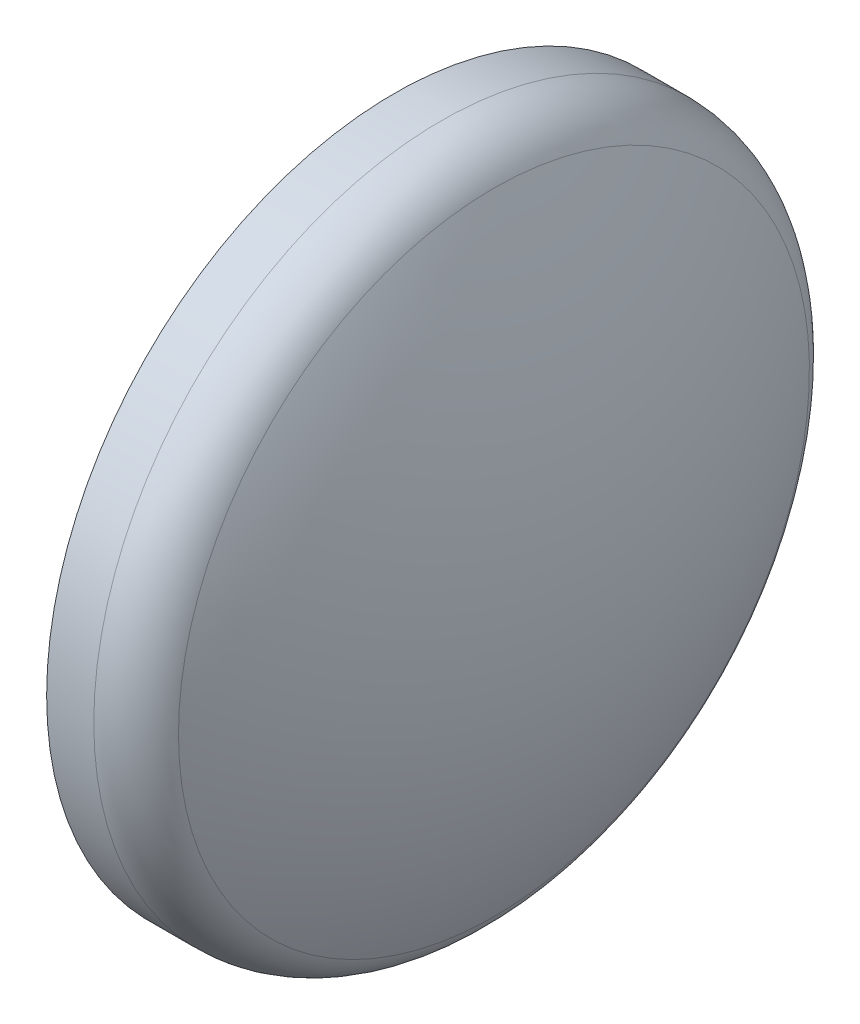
ISO-10303-21;
HEADER;
FILE_DESCRIPTION(('STEP AP214'),'2;1');
FILE_NAME('part.step','',(''),(''),'','','');
FILE_SCHEMA(('AUTOMOTIVE_DESIGN { 1 0 10303 214 1 1 1 1 }'));
ENDSEC;
DATA;
#1=APPLICATION_CONTEXT('core data for automotive mechanical design processes');
#2=APPLICATION_PROTOCOL_DEFINITION('international standard','automotive_design',2000,#1);
#3=PRODUCT_CONTEXT('',#1,'mechanical');
#4=PRODUCT('Part','Part','',(#3));
#5=PRODUCT_RELATED_PRODUCT_CATEGORY('part','',(#4));
#6=PRODUCT_DEFINITION_FORMATION('','',#4);
#7=PRODUCT_DEFINITION_CONTEXT('part definition',#1,'design');
#8=PRODUCT_DEFINITION('design','',#6,#7);
#9=PRODUCT_DEFINITION_SHAPE('','',#8);
#10=(LENGTH_UNIT() NAMED_UNIT(*) SI_UNIT(.MILLI.,.METRE.));
#11=(NAMED_UNIT(*) PLANE_ANGLE_UNIT() SI_UNIT($,.RADIAN.));
#12=(NAMED_UNIT(*) SI_UNIT($,.STERADIAN.) SOLID_ANGLE_UNIT());
#13=UNCERTAINTY_MEASURE_WITH_UNIT(LENGTH_MEASURE(1.E-05),#10,'distance_accuracy_value','');
#14=(GEOMETRIC_REPRESENTATION_CONTEXT(3) GLOBAL_UNCERTAINTY_ASSIGNED_CONTEXT((#13)) GLOBAL_UNIT_ASSIGNED_CONTEXT((#10,
#11,#12)) REPRESENTATION_CONTEXT('',''));
#15=CARTESIAN_POINT('',(0.,0.,0.));
#16=DIRECTION('',(0.,0.,1.));
#17=DIRECTION('',(1.,0.,0.));
#18=AXIS2_PLACEMENT_3D('',#15,#16,#17);
#19=CARTESIAN_POINT('',(550.,0.,0.));
#20=DIRECTION('',(1.,0.,0.));
#21=DIRECTION('',(0.,0.,-1.));
#22=AXIS2_PLACEMENT_3D('',#19,#20,#21);
#23=PLANE('',#22);
#24=CARTESIAN_POINT('',(550.,0.,0.));
#25=DIRECTION('',(-1.,0.,0.));
#26=DIRECTION('',(0.,0.,1.));
#27=AXIS2_PLACEMENT_3D('',#24,#25,#26);
#28=CIRCLE('',#27,295.);
#29=CARTESIAN_POINT('',(550.,0.,295.));
#30=VERTEX_POINT('',#29);
#31=EDGE_CURVE('E10',#30,#30,#28,.T.);
#32=ORIENTED_EDGE('',*,*,#31,.T.);
#33=EDGE_LOOP('',(#32));
#34=FACE_BOUND('',#33,.T.);
#35=ADVANCED_FACE('F29',(#34),#23,.F.);
#36=CARTESIAN_POINT('',(57.190131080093,0.,0.));
#37=DIRECTION('',(-1.,0.,0.));
#38=DIRECTION('',(0.,0.,1.));
#39=AXIS2_PLACEMENT_3D('',#36,#37,#38);
#40=CYLINDRICAL_SURFACE('',#39,295.);
#41=ORIENTED_EDGE('',*,*,#31,.F.);
#42=EDGE_LOOP('',(#41));
#43=FACE_BOUND('',#42,.T.);
#44=CARTESIAN_POINT('',(590.,0.,0.));
#45=DIRECTION('',(-1.,0.,0.));
#46=DIRECTION('',(0.,0.,1.));
#47=AXIS2_PLACEMENT_3D('',#44,#45,#46);
#48=CIRCLE('',#47,295.);
#49=CARTESIAN_POINT('',(590.,0.,295.));
#50=VERTEX_POINT('',#49);
#51=EDGE_CURVE('E35',#50,#50,#48,.T.);
#52=ORIENTED_EDGE('',*,*,#51,.T.);
#53=EDGE_LOOP('',(#52));
#54=FACE_BOUND('',#53,.T.);
#55=ADVANCED_FACE('F54',(#43,#54),#40,.T.);
#56=CARTESIAN_POINT('',(590.,0.,0.));
#57=DIRECTION('',(-1.,0.,0.));
#58=DIRECTION('',(0.,0.,1.));
#59=AXIS2_PLACEMENT_3D('',#56,#57,#58);
#60=TOROIDAL_SURFACE('',#59,245.,49.9999999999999);
#61=ORIENTED_EDGE('',*,*,#51,.F.);
#62=EDGE_LOOP('',(#61));
#63=FACE_BOUND('',#62,.T.);
#64=CARTESIAN_POINT('',(634.557629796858,0.,0.));
#65=DIRECTION('',(-1.,0.,0.));
#66=DIRECTION('',(0.,0.,1.));
#67=AXIS2_PLACEMENT_3D('',#64,#65,#66);
#68=CIRCLE('',#67,267.685185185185);
#69=CARTESIAN_POINT('',(634.557629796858,0.,267.685185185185));
#70=VERTEX_POINT('',#69);
#71=EDGE_CURVE('E39',#70,#70,#68,.T.);
#72=ORIENTED_EDGE('',*,*,#71,.T.);
#73=EDGE_LOOP('',(#72));
#74=FACE_BOUND('',#73,.T.);
#75=ADVANCED_FACE('F46',(#63,#74),#60,.T.);
#76=CARTESIAN_POINT('',(108.777598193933,0.,0.));
#77=DIRECTION('',(-1.,0.,0.));
#78=DIRECTION('',(0.,1.,0.));
#79=AXIS2_PLACEMENT_3D('',#76,#77,#78);
#80=SPHERICAL_SURFACE('',#79,590.);
#81=ORIENTED_EDGE('',*,*,#71,.F.);
#82=EDGE_LOOP('',(#81));
#83=FACE_BOUND('',#82,.T.);
#84=ADVANCED_FACE('F48',(#83),#80,.T.);
#85=CLOSED_SHELL('',(#35,#55,#75,#84));
#86=MANIFOLD_SOLID_BREP('B2',#85);
#87=ADVANCED_BREP_SHAPE_REPRESENTATION('',(#18,#86),#14);
#88=SHAPE_DEFINITION_REPRESENTATION(#9,#87);
ENDSEC;
END-ISO-10303-21;
